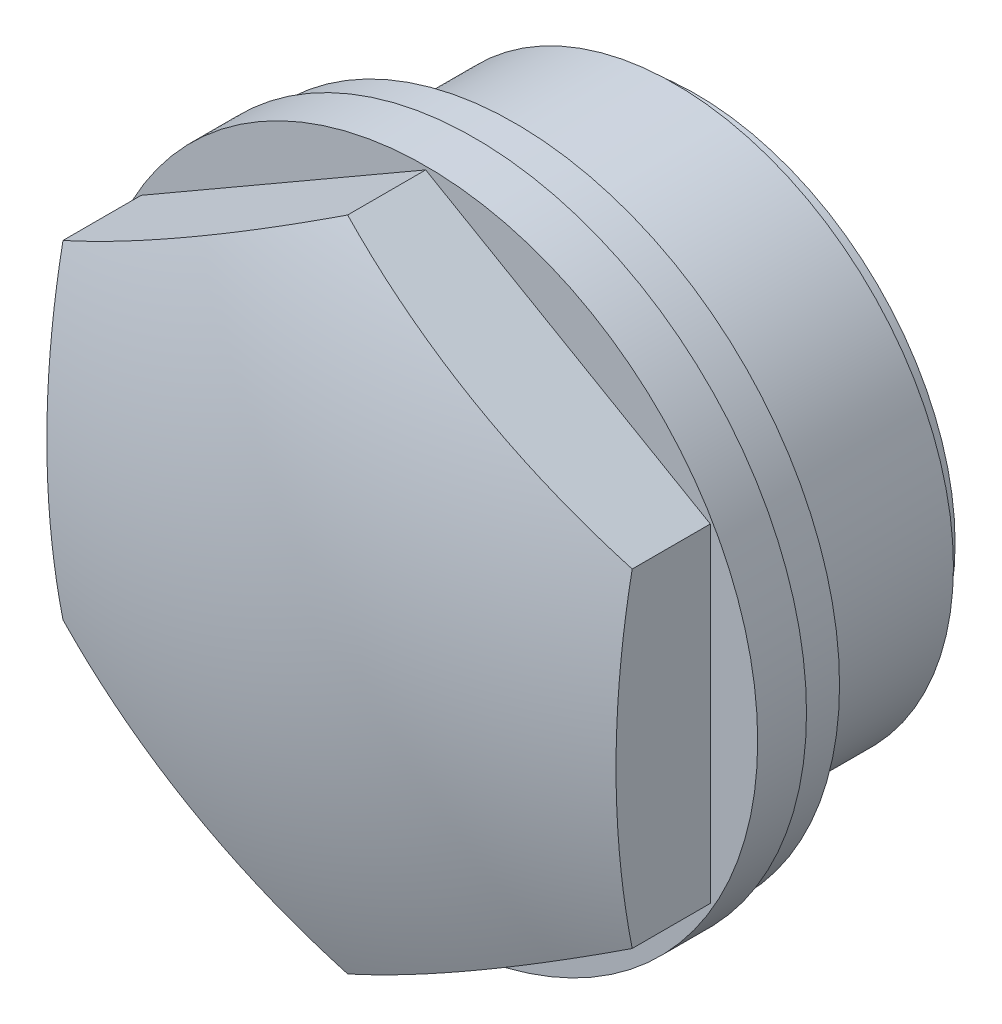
ISO-10303-21;
HEADER;
FILE_DESCRIPTION(('STEP AP214'),'2;1');
FILE_NAME('part.step','',(''),(''),'','','');
FILE_SCHEMA(('AUTOMOTIVE_DESIGN { 1 0 10303 214 1 1 1 1 }'));
ENDSEC;
DATA;
#1=APPLICATION_CONTEXT('core data for automotive mechanical design processes');
#2=APPLICATION_PROTOCOL_DEFINITION('international standard','automotive_design',2000,#1);
#3=PRODUCT_CONTEXT('',#1,'mechanical');
#4=PRODUCT('Part','Part','',(#3));
#5=PRODUCT_RELATED_PRODUCT_CATEGORY('part','',(#4));
#6=PRODUCT_DEFINITION_FORMATION('','',#4);
#7=PRODUCT_DEFINITION_CONTEXT('part definition',#1,'design');
#8=PRODUCT_DEFINITION('design','',#6,#7);
#9=PRODUCT_DEFINITION_SHAPE('','',#8);
#10=(LENGTH_UNIT() NAMED_UNIT(*) SI_UNIT(.MILLI.,.METRE.));
#11=(NAMED_UNIT(*) PLANE_ANGLE_UNIT() SI_UNIT($,.RADIAN.));
#12=(NAMED_UNIT(*) SI_UNIT($,.STERADIAN.) SOLID_ANGLE_UNIT());
#13=UNCERTAINTY_MEASURE_WITH_UNIT(LENGTH_MEASURE(1.E-05),#10,'distance_accuracy_value','');
#14=(GEOMETRIC_REPRESENTATION_CONTEXT(3) GLOBAL_UNCERTAINTY_ASSIGNED_CONTEXT((#13)) GLOBAL_UNIT_ASSIGNED_CONTEXT((#10,
#11,#12)) REPRESENTATION_CONTEXT('',''));
#15=CARTESIAN_POINT('',(0.,0.,0.));
#16=DIRECTION('',(0.,0.,1.));
#17=DIRECTION('',(1.,0.,0.));
#18=AXIS2_PLACEMENT_3D('',#15,#16,#17);
#19=CARTESIAN_POINT('',(0.,0.,10.929));
#20=DIRECTION('',(0.,0.,1.));
#21=DIRECTION('',(1.,0.,0.));
#22=AXIS2_PLACEMENT_3D('',#19,#20,#21);
#23=CYLINDRICAL_SURFACE('',#22,15.75);
#24=CARTESIAN_POINT('',(0.,0.,4.2438148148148));
#25=DIRECTION('',(0.,0.,1.));
#26=DIRECTION('',(1.,0.,0.));
#27=AXIS2_PLACEMENT_3D('',#24,#25,#26);
#28=CIRCLE('',#27,15.75);
#29=CARTESIAN_POINT('',(15.75,0.,4.24381481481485));
#30=VERTEX_POINT('',#29);
#31=EDGE_CURVE('E142',#30,#30,#28,.T.);
#32=ORIENTED_EDGE('',*,*,#31,.F.);
#33=EDGE_LOOP('',(#32));
#34=FACE_BOUND('',#33,.T.);
#35=CARTESIAN_POINT('',(0.,0.,1.929));
#36=DIRECTION('',(0.,0.,1.));
#37=DIRECTION('',(1.,0.,0.));
#38=AXIS2_PLACEMENT_3D('',#35,#36,#37);
#39=CIRCLE('',#38,15.75);
#40=CARTESIAN_POINT('',(15.75,0.,1.92900000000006));
#41=VERTEX_POINT('',#40);
#42=EDGE_CURVE('E110',#41,#41,#39,.T.);
#43=ORIENTED_EDGE('',*,*,#42,.T.);
#44=EDGE_LOOP('',(#43));
#45=FACE_BOUND('',#44,.T.);
#46=ADVANCED_FACE('F14',(#34,#45),#23,.T.);
#47=CARTESIAN_POINT('',(0.,0.,-33.5624999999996));
#48=DIRECTION('',(0.,0.,1.));
#49=DIRECTION('',(0.,-1.,0.));
#50=AXIS2_PLACEMENT_3D('',#47,#48,#49);
#51=SPHERICAL_SURFACE('',#50,42.2415);
#52=CARTESIAN_POINT('',(0.,0.,7.4033445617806));
#53=DIRECTION('',(0.,0.,1.));
#54=DIRECTION('',(1.,0.,0.));
#55=AXIS2_PLACEMENT_3D('',#52,#53,#54);
#56=CIRCLE('',#55,10.3026162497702);
#57=CARTESIAN_POINT('',(10.3026162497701,0.,7.40334456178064));
#58=VERTEX_POINT('',#57);
#59=EDGE_CURVE('E134',#58,#58,#56,.T.);
#60=ORIENTED_EDGE('',*,*,#59,.F.);
#61=EDGE_LOOP('',(#60));
#62=FACE_BOUND('',#61,.T.);
#63=ADVANCED_FACE('F16',(#62),#51,.F.);
#64=CARTESIAN_POINT('',(0.,0.,7.4033445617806));
#65=DIRECTION('',(0.,0.,-1.));
#66=DIRECTION('',(-1.,0.,0.));
#67=AXIS2_PLACEMENT_3D('',#64,#65,#66);
#68=CONICAL_SURFACE('',#67,10.3026162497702,0.0349065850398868);
#69=CARTESIAN_POINT('',(0.,0.,-8.571));
#70=DIRECTION('',(0.,0.,1.));
#71=DIRECTION('',(1.,0.,0.));
#72=AXIS2_PLACEMENT_3D('',#69,#70,#71);
#73=CIRCLE('',#72,10.8604526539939);
#74=CARTESIAN_POINT('',(10.8604526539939,0.,-8.57099999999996));
#75=VERTEX_POINT('',#74);
#76=EDGE_CURVE('E131',#75,#75,#73,.T.);
#77=ORIENTED_EDGE('',*,*,#76,.F.);
#78=EDGE_LOOP('',(#77));
#79=FACE_BOUND('',#78,.T.);
#80=ORIENTED_EDGE('',*,*,#59,.T.);
#81=EDGE_LOOP('',(#80));
#82=FACE_BOUND('',#81,.T.);
#83=ADVANCED_FACE('F173',(#79,#82),#68,.F.);
#84=CARTESIAN_POINT('',(0.,10.8604526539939,-8.571));
#85=DIRECTION('',(0.,0.,1.));
#86=DIRECTION('',(1.,0.,0.));
#87=AXIS2_PLACEMENT_3D('',#84,#85,#86);
#88=PLANE('',#87);
#89=CARTESIAN_POINT('',(0.,0.,-8.571));
#90=DIRECTION('',(0.,0.,1.));
#91=DIRECTION('',(1.,0.,0.));
#92=AXIS2_PLACEMENT_3D('',#89,#90,#91);
#93=CIRCLE('',#92,12.2998475);
#94=CARTESIAN_POINT('',(12.2998475,0.,-8.57099999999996));
#95=VERTEX_POINT('',#94);
#96=EDGE_CURVE('E128',#95,#95,#93,.T.);
#97=ORIENTED_EDGE('',*,*,#96,.F.);
#98=EDGE_LOOP('',(#97));
#99=FACE_BOUND('',#98,.T.);
#100=ORIENTED_EDGE('',*,*,#76,.T.);
#101=EDGE_LOOP('',(#100));
#102=FACE_BOUND('',#101,.T.);
#103=ADVANCED_FACE('F203',(#99,#102),#88,.F.);
#104=CARTESIAN_POINT('',(0.,0.,10.929));
#105=DIRECTION('',(0.,0.,1.));
#106=DIRECTION('',(1.,0.,0.));
#107=AXIS2_PLACEMENT_3D('',#104,#105,#106);
#108=CYLINDRICAL_SURFACE('',#107,12.2998475);
#109=CARTESIAN_POINT('',(0.,0.,-7.571));
#110=DIRECTION('',(0.,0.,1.));
#111=DIRECTION('',(1.,0.,0.));
#112=AXIS2_PLACEMENT_3D('',#109,#110,#111);
#113=CIRCLE('',#112,12.2998475);
#114=CARTESIAN_POINT('',(12.2998475,0.,-7.57099999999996));
#115=VERTEX_POINT('',#114);
#116=EDGE_CURVE('E125',#115,#115,#113,.T.);
#117=ORIENTED_EDGE('',*,*,#116,.F.);
#118=EDGE_LOOP('',(#117));
#119=FACE_BOUND('',#118,.T.);
#120=ORIENTED_EDGE('',*,*,#96,.T.);
#121=EDGE_LOOP('',(#120));
#122=FACE_BOUND('',#121,.T.);
#123=ADVANCED_FACE('F199',(#119,#122),#108,.T.);
#124=CARTESIAN_POINT('',(0.,12.2998475,-7.571));
#125=DIRECTION('',(0.,0.,1.));
#126=DIRECTION('',(1.,0.,0.));
#127=AXIS2_PLACEMENT_3D('',#124,#125,#126);
#128=PLANE('',#127);
#129=CARTESIAN_POINT('',(0.,0.,-7.571));
#130=DIRECTION('',(0.,0.,1.));
#131=DIRECTION('',(1.,0.,0.));
#132=AXIS2_PLACEMENT_3D('',#129,#130,#131);
#133=CIRCLE('',#132,13.22);
#134=CARTESIAN_POINT('',(13.22,0.,-7.57099999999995));
#135=VERTEX_POINT('',#134);
#136=EDGE_CURVE('E122',#135,#135,#133,.T.);
#137=ORIENTED_EDGE('',*,*,#136,.F.);
#138=EDGE_LOOP('',(#137));
#139=FACE_BOUND('',#138,.T.);
#140=ORIENTED_EDGE('',*,*,#116,.T.);
#141=EDGE_LOOP('',(#140));
#142=FACE_BOUND('',#141,.T.);
#143=ADVANCED_FACE('F195',(#139,#142),#128,.F.);
#144=CARTESIAN_POINT('',(0.,0.,10.929));
#145=DIRECTION('',(0.,0.,1.));
#146=DIRECTION('',(1.,0.,0.));
#147=AXIS2_PLACEMENT_3D('',#144,#145,#146);
#148=CYLINDRICAL_SURFACE('',#147,13.22);
#149=CARTESIAN_POINT('',(0.,0.,0.000153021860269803));
#150=DIRECTION('',(0.,0.,1.));
#151=DIRECTION('',(1.,0.,0.));
#152=AXIS2_PLACEMENT_3D('',#149,#150,#151);
#153=CIRCLE('',#152,13.22);
#154=CARTESIAN_POINT('',(13.22,0.,0.00015302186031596));
#155=VERTEX_POINT('',#154);
#156=EDGE_CURVE('E119',#155,#155,#153,.T.);
#157=ORIENTED_EDGE('',*,*,#156,.F.);
#158=EDGE_LOOP('',(#157));
#159=FACE_BOUND('',#158,.T.);
#160=ORIENTED_EDGE('',*,*,#136,.T.);
#161=EDGE_LOOP('',(#160));
#162=FACE_BOUND('',#161,.T.);
#163=ADVANCED_FACE('F191',(#159,#162),#148,.T.);
#164=CARTESIAN_POINT('',(0.,13.22,0.000153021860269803));
#165=DIRECTION('',(0.,0.,1.));
#166=DIRECTION('',(1.,0.,0.));
#167=AXIS2_PLACEMENT_3D('',#164,#165,#166);
#168=PLANE('',#167);
#169=CARTESIAN_POINT('',(0.,0.,0.000153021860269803));
#170=DIRECTION('',(0.,0.,1.));
#171=DIRECTION('',(1.,0.,0.));
#172=AXIS2_PLACEMENT_3D('',#169,#170,#171);
#173=CIRCLE('',#172,15.38775);
#174=CARTESIAN_POINT('',(15.38775,0.,0.000153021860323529));
#175=VERTEX_POINT('',#174);
#176=EDGE_CURVE('E116',#175,#175,#173,.T.);
#177=ORIENTED_EDGE('',*,*,#176,.F.);
#178=EDGE_LOOP('',(#177));
#179=FACE_BOUND('',#178,.T.);
#180=ORIENTED_EDGE('',*,*,#156,.T.);
#181=EDGE_LOOP('',(#180));
#182=FACE_BOUND('',#181,.T.);
#183=ADVANCED_FACE('F187',(#179,#182),#168,.F.);
#184=CARTESIAN_POINT('',(0.,0.,10.929));
#185=DIRECTION('',(0.,0.,1.));
#186=DIRECTION('',(1.,0.,0.));
#187=AXIS2_PLACEMENT_3D('',#184,#185,#186);
#188=CYLINDRICAL_SURFACE('',#187,15.38775);
#189=CARTESIAN_POINT('',(0.,0.,1.929));
#190=DIRECTION('',(0.,0.,1.));
#191=DIRECTION('',(1.,0.,0.));
#192=AXIS2_PLACEMENT_3D('',#189,#190,#191);
#193=CIRCLE('',#192,15.38775);
#194=CARTESIAN_POINT('',(15.38775,0.,1.92900000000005));
#195=VERTEX_POINT('',#194);
#196=EDGE_CURVE('E113',#195,#195,#193,.T.);
#197=ORIENTED_EDGE('',*,*,#196,.F.);
#198=EDGE_LOOP('',(#197));
#199=FACE_BOUND('',#198,.T.);
#200=ORIENTED_EDGE('',*,*,#176,.T.);
#201=EDGE_LOOP('',(#200));
#202=FACE_BOUND('',#201,.T.);
#203=ADVANCED_FACE('F183',(#199,#202),#188,.T.);
#204=CARTESIAN_POINT('',(0.,15.38775,1.929));
#205=DIRECTION('',(0.,0.,1.));
#206=DIRECTION('',(1.,0.,0.));
#207=AXIS2_PLACEMENT_3D('',#204,#205,#206);
#208=PLANE('',#207);
#209=ORIENTED_EDGE('',*,*,#42,.F.);
#210=EDGE_LOOP('',(#209));
#211=FACE_BOUND('',#210,.T.);
#212=ORIENTED_EDGE('',*,*,#196,.T.);
#213=EDGE_LOOP('',(#212));
#214=FACE_BOUND('',#213,.T.);
#215=ADVANCED_FACE('F180',(#211,#214),#208,.F.);
#216=CARTESIAN_POINT('',(0.,0.,-31.3125));
#217=DIRECTION('',(0.,0.,1.));
#218=DIRECTION('',(0.,-1.,0.));
#219=AXIS2_PLACEMENT_3D('',#216,#217,#218);
#220=SPHERICAL_SURFACE('',#219,42.2415);
#221=CARTESIAN_POINT('',(6.75000000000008,11.6913429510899,-31.3125));
#222=DIRECTION('',(-0.5,-0.866025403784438,0.));
#223=DIRECTION('',(0.866025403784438,-0.5,0.));
#224=AXIS2_PLACEMENT_3D('',#221,#222,#223);
#225=CIRCLE('',#224,40.026170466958);
#226=CARTESIAN_POINT('',(0.,15.5884572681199,7.9474582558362));
#227=VERTEX_POINT('',#226);
#228=CARTESIAN_POINT('',(13.5,7.79422863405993,7.9474582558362));
#229=VERTEX_POINT('',#228);
#230=EDGE_CURVE('E86',#227,#229,#225,.F.);
#231=ORIENTED_EDGE('',*,*,#230,.F.);
#232=CARTESIAN_POINT('',(-6.74999999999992,11.6913429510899,-31.3125));
#233=DIRECTION('',(0.5,-0.866025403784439,0.));
#234=DIRECTION('',(0.866025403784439,0.5,0.));
#235=AXIS2_PLACEMENT_3D('',#232,#233,#234);
#236=CIRCLE('',#235,40.026170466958);
#237=CARTESIAN_POINT('',(-13.5,7.79422863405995,7.9474582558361));
#238=VERTEX_POINT('',#237);
#239=EDGE_CURVE('E137',#238,#227,#236,.F.);
#240=ORIENTED_EDGE('',*,*,#239,.F.);
#241=CARTESIAN_POINT('',(-13.5,0.,-31.3125));
#242=DIRECTION('',(1.,0.,0.));
#243=DIRECTION('',(0.,0.,-1.));
#244=AXIS2_PLACEMENT_3D('',#241,#242,#243);
#245=CIRCLE('',#244,40.026170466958);
#246=CARTESIAN_POINT('',(-13.5,-7.79422863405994,7.9474582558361));
#247=VERTEX_POINT('',#246);
#248=EDGE_CURVE('E36',#247,#238,#245,.F.);
#249=ORIENTED_EDGE('',*,*,#248,.F.);
#250=CARTESIAN_POINT('',(-6.74999999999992,-11.6913429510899,-31.3125));
#251=DIRECTION('',(0.5,0.866025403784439,0.));
#252=DIRECTION('',(-0.866025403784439,0.5,0.));
#253=AXIS2_PLACEMENT_3D('',#250,#251,#252);
#254=CIRCLE('',#253,40.026170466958);
#255=CARTESIAN_POINT('',(0.,-15.5884572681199,7.94745825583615));
#256=VERTEX_POINT('',#255);
#257=EDGE_CURVE('E29',#256,#247,#254,.F.);
#258=ORIENTED_EDGE('',*,*,#257,.F.);
#259=CARTESIAN_POINT('',(6.75000000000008,-11.6913429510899,-31.3125));
#260=DIRECTION('',(-0.5,0.866025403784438,0.));
#261=DIRECTION('',(-0.866025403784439,-0.5,0.));
#262=AXIS2_PLACEMENT_3D('',#259,#260,#261);
#263=CIRCLE('',#262,40.026170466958);
#264=CARTESIAN_POINT('',(13.5,-7.79422863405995,7.9474582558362));
#265=VERTEX_POINT('',#264);
#266=EDGE_CURVE('E99',#265,#256,#263,.F.);
#267=ORIENTED_EDGE('',*,*,#266,.F.);
#268=CARTESIAN_POINT('',(13.5,0.,-31.3125));
#269=DIRECTION('',(-1.,0.,0.));
#270=DIRECTION('',(0.,0.,1.));
#271=AXIS2_PLACEMENT_3D('',#268,#269,#270);
#272=CIRCLE('',#271,40.026170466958);
#273=EDGE_CURVE('E9',#229,#265,#272,.F.);
#274=ORIENTED_EDGE('',*,*,#273,.F.);
#275=EDGE_LOOP('',(#231,#240,#249,#258,#267,#274));
#276=FACE_BOUND('',#275,.T.);
#277=ADVANCED_FACE('F151',(#276),#220,.T.);
#278=CARTESIAN_POINT('',(0.,0.,4.2438148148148));
#279=DIRECTION('',(0.,0.,1.));
#280=DIRECTION('',(1.,0.,0.));
#281=AXIS2_PLACEMENT_3D('',#278,#279,#280);
#282=PLANE('',#281);
#283=DIRECTION('',(0.866025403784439,0.5,0.));
#284=VECTOR('',#283,1.);
#285=CARTESIAN_POINT('',(-13.5,7.79422863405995,4.24381481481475));
#286=LINE('',#285,#284);
#287=CARTESIAN_POINT('',(-13.5,7.79422863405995,4.24381481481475));
#288=VERTEX_POINT('',#287);
#289=CARTESIAN_POINT('',(0.,15.5884572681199,4.2438148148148));
#290=VERTEX_POINT('',#289);
#291=EDGE_CURVE('E78',#288,#290,#286,.T.);
#292=ORIENTED_EDGE('',*,*,#291,.T.);
#293=DIRECTION('',(0.866025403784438,-0.5,0.));
#294=VECTOR('',#293,1.);
#295=CARTESIAN_POINT('',(-0.100000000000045,15.6461922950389,4.2438148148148));
#296=LINE('',#295,#294);
#297=CARTESIAN_POINT('',(13.5,7.79422863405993,4.24381481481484));
#298=VERTEX_POINT('',#297);
#299=EDGE_CURVE('E68',#290,#298,#296,.T.);
#300=ORIENTED_EDGE('',*,*,#299,.T.);
#301=DIRECTION('',(0.,-1.,0.));
#302=VECTOR('',#301,1.);
#303=CARTESIAN_POINT('',(13.5,7.79422863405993,4.24381481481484));
#304=LINE('',#303,#302);
#305=CARTESIAN_POINT('',(13.5,-7.79422863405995,4.24381481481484));
#306=VERTEX_POINT('',#305);
#307=EDGE_CURVE('E74',#298,#306,#304,.T.);
#308=ORIENTED_EDGE('',*,*,#307,.T.);
#309=DIRECTION('',(-0.866025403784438,-0.5,0.));
#310=VECTOR('',#309,1.);
#311=CARTESIAN_POINT('',(13.5,-7.79422863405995,4.24381481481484));
#312=LINE('',#311,#310);
#313=CARTESIAN_POINT('',(0.,-15.5884572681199,4.2438148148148));
#314=VERTEX_POINT('',#313);
#315=EDGE_CURVE('E93',#306,#314,#312,.T.);
#316=ORIENTED_EDGE('',*,*,#315,.T.);
#317=DIRECTION('',(-0.866025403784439,0.5,0.));
#318=VECTOR('',#317,1.);
#319=CARTESIAN_POINT('',(0.0999999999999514,-15.6461922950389,4.2438148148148));
#320=LINE('',#319,#318);
#321=CARTESIAN_POINT('',(-13.5,-7.79422863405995,4.24381481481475));
#322=VERTEX_POINT('',#321);
#323=EDGE_CURVE('E101',#314,#322,#320,.T.);
#324=ORIENTED_EDGE('',*,*,#323,.T.);
#325=DIRECTION('',(0.,1.,0.));
#326=VECTOR('',#325,1.);
#327=CARTESIAN_POINT('',(-13.5,-7.79422863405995,4.24381481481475));
#328=LINE('',#327,#326);
#329=EDGE_CURVE('E103',#322,#288,#328,.T.);
#330=ORIENTED_EDGE('',*,*,#329,.T.);
#331=EDGE_LOOP('',(#292,#300,#308,#316,#324,#330));
#332=FACE_BOUND('',#331,.T.);
#333=ORIENTED_EDGE('',*,*,#31,.T.);
#334=EDGE_LOOP('',(#333));
#335=FACE_BOUND('',#334,.T.);
#336=ADVANCED_FACE('F70',(#332,#335),#282,.T.);
#337=CARTESIAN_POINT('',(0.0999999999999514,-15.6461922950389,4.2438148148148));
#338=DIRECTION('',(0.5,0.866025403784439,0.));
#339=DIRECTION('',(-0.866025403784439,0.5,0.));
#340=AXIS2_PLACEMENT_3D('',#337,#338,#339);
#341=PLANE('',#340);
#342=ORIENTED_EDGE('',*,*,#323,.F.);
#343=DIRECTION('',(0.,0.,1.));
#344=VECTOR('',#343,1.);
#345=CARTESIAN_POINT('',(0.,-15.5884572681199,4.2438148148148));
#346=LINE('',#345,#344);
#347=EDGE_CURVE('E22',#314,#256,#346,.T.);
#348=ORIENTED_EDGE('',*,*,#347,.T.);
#349=ORIENTED_EDGE('',*,*,#257,.T.);
#350=DIRECTION('',(0.,0.,1.));
#351=VECTOR('',#350,1.);
#352=CARTESIAN_POINT('',(-13.5,-7.79422863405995,4.24381481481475));
#353=LINE('',#352,#351);
#354=EDGE_CURVE('E108',#322,#247,#353,.T.);
#355=ORIENTED_EDGE('',*,*,#354,.F.);
#356=EDGE_LOOP('',(#342,#348,#349,#355));
#357=FACE_BOUND('',#356,.T.);
#358=ADVANCED_FACE('F147',(#357),#341,.F.);
#359=CARTESIAN_POINT('',(-13.5,-7.79422863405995,4.24381481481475));
#360=DIRECTION('',(1.,0.,0.));
#361=DIRECTION('',(0.,0.,-1.));
#362=AXIS2_PLACEMENT_3D('',#359,#360,#361);
#363=PLANE('',#362);
#364=ORIENTED_EDGE('',*,*,#248,.T.);
#365=DIRECTION('',(0.,0.,1.));
#366=VECTOR('',#365,1.);
#367=CARTESIAN_POINT('',(-13.5,7.79422863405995,4.24381481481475));
#368=LINE('',#367,#366);
#369=EDGE_CURVE('E106',#288,#238,#368,.T.);
#370=ORIENTED_EDGE('',*,*,#369,.F.);
#371=ORIENTED_EDGE('',*,*,#329,.F.);
#372=ORIENTED_EDGE('',*,*,#354,.T.);
#373=EDGE_LOOP('',(#364,#370,#371,#372));
#374=FACE_BOUND('',#373,.T.);
#375=ADVANCED_FACE('F156',(#374),#363,.F.);
#376=CARTESIAN_POINT('',(-13.5,7.79422863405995,4.24381481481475));
#377=DIRECTION('',(0.5,-0.866025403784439,0.));
#378=DIRECTION('',(0.866025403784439,0.5,0.));
#379=AXIS2_PLACEMENT_3D('',#376,#377,#378);
#380=PLANE('',#379);
#381=ORIENTED_EDGE('',*,*,#239,.T.);
#382=DIRECTION('',(0.,0.,-1.));
#383=VECTOR('',#382,1.);
#384=CARTESIAN_POINT('',(0.,15.5884572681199,4.2438148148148));
#385=LINE('',#384,#383);
#386=EDGE_CURVE('E145',#227,#290,#385,.T.);
#387=ORIENTED_EDGE('',*,*,#386,.T.);
#388=ORIENTED_EDGE('',*,*,#291,.F.);
#389=ORIENTED_EDGE('',*,*,#369,.T.);
#390=EDGE_LOOP('',(#381,#387,#388,#389));
#391=FACE_BOUND('',#390,.T.);
#392=ADVANCED_FACE('F154',(#391),#380,.F.);
#393=CARTESIAN_POINT('',(-0.100000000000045,15.6461922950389,4.2438148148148));
#394=DIRECTION('',(-0.5,-0.866025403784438,0.));
#395=DIRECTION('',(0.866025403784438,-0.5,0.));
#396=AXIS2_PLACEMENT_3D('',#393,#394,#395);
#397=PLANE('',#396);
#398=ORIENTED_EDGE('',*,*,#230,.T.);
#399=DIRECTION('',(0.,0.,1.));
#400=VECTOR('',#399,1.);
#401=CARTESIAN_POINT('',(13.5,7.79422863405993,4.24381481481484));
#402=LINE('',#401,#400);
#403=EDGE_CURVE('E83',#298,#229,#402,.T.);
#404=ORIENTED_EDGE('',*,*,#403,.F.);
#405=ORIENTED_EDGE('',*,*,#299,.F.);
#406=ORIENTED_EDGE('',*,*,#386,.F.);
#407=EDGE_LOOP('',(#398,#404,#405,#406));
#408=FACE_BOUND('',#407,.T.);
#409=ADVANCED_FACE('F84',(#408),#397,.F.);
#410=CARTESIAN_POINT('',(13.5,7.79422863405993,4.24381481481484));
#411=DIRECTION('',(-1.,0.,0.));
#412=DIRECTION('',(0.,0.,1.));
#413=AXIS2_PLACEMENT_3D('',#410,#411,#412);
#414=PLANE('',#413);
#415=ORIENTED_EDGE('',*,*,#273,.T.);
#416=DIRECTION('',(0.,0.,1.));
#417=VECTOR('',#416,1.);
#418=CARTESIAN_POINT('',(13.5,-7.79422863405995,4.24381481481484));
#419=LINE('',#418,#417);
#420=EDGE_CURVE('E89',#306,#265,#419,.T.);
#421=ORIENTED_EDGE('',*,*,#420,.F.);
#422=ORIENTED_EDGE('',*,*,#307,.F.);
#423=ORIENTED_EDGE('',*,*,#403,.T.);
#424=EDGE_LOOP('',(#415,#421,#422,#423));
#425=FACE_BOUND('',#424,.T.);
#426=ADVANCED_FACE('F91',(#425),#414,.F.);
#427=CARTESIAN_POINT('',(13.5,-7.79422863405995,4.24381481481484));
#428=DIRECTION('',(-0.5,0.866025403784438,0.));
#429=DIRECTION('',(-0.866025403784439,-0.5,0.));
#430=AXIS2_PLACEMENT_3D('',#427,#428,#429);
#431=PLANE('',#430);
#432=ORIENTED_EDGE('',*,*,#266,.T.);
#433=ORIENTED_EDGE('',*,*,#347,.F.);
#434=ORIENTED_EDGE('',*,*,#315,.F.);
#435=ORIENTED_EDGE('',*,*,#420,.T.);
#436=EDGE_LOOP('',(#432,#433,#434,#435));
#437=FACE_BOUND('',#436,.T.);
#438=ADVANCED_FACE('F157',(#437),#431,.F.);
#439=CLOSED_SHELL('',(#46,#63,#83,#103,#123,#143,#163,#183,#203,#215,#277,#336,#358,#375,#392,
#409,#426,#438));
#440=MANIFOLD_SOLID_BREP('B1',#439);
#441=ADVANCED_BREP_SHAPE_REPRESENTATION('',(#18,#440),#14);
#442=SHAPE_DEFINITION_REPRESENTATION(#9,#441);
ENDSEC;
END-ISO-10303-21;
